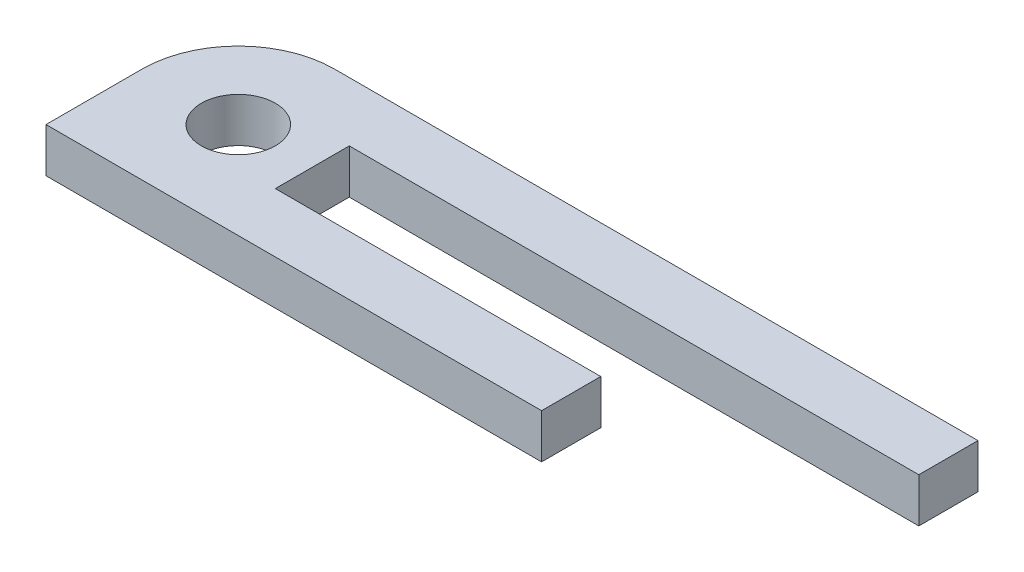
from build123d import *

# Parameters (mm, degrees)
SKETCH1_R      = 5
EXTRUDE1_DEPTH = 6


with BuildPart() as part:
    # Sketch1 → Extrude1 (new body)
    with BuildSketch(Plane(origin=(0, 0, 0), x_dir=(1, 0, 0), z_dir=(0, 1, 0))):
        with BuildLine():
            Line((0, 0), (67, 0))
            Line((67, 0), (67, 8))
            Line((67, 8), (23, 8))
            Line((23, 8), (23, 18))
            Line((23, 18), (100, 18))
            Line((100, 18), (100, 26))
            Line((100, 26), (13, 26))
            ThreePointArc((13, 26), (3.807611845, 22.192388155), (0, 13))
            Line((0, 13), (0, 0))
        make_face()
        with Locations(Location((13, 13, 0), (0, 0, 270))):
            Circle(SKETCH1_R, mode=Mode.SUBTRACT)
    extrude(amount=EXTRUDE1_DEPTH)


solid = part.part
